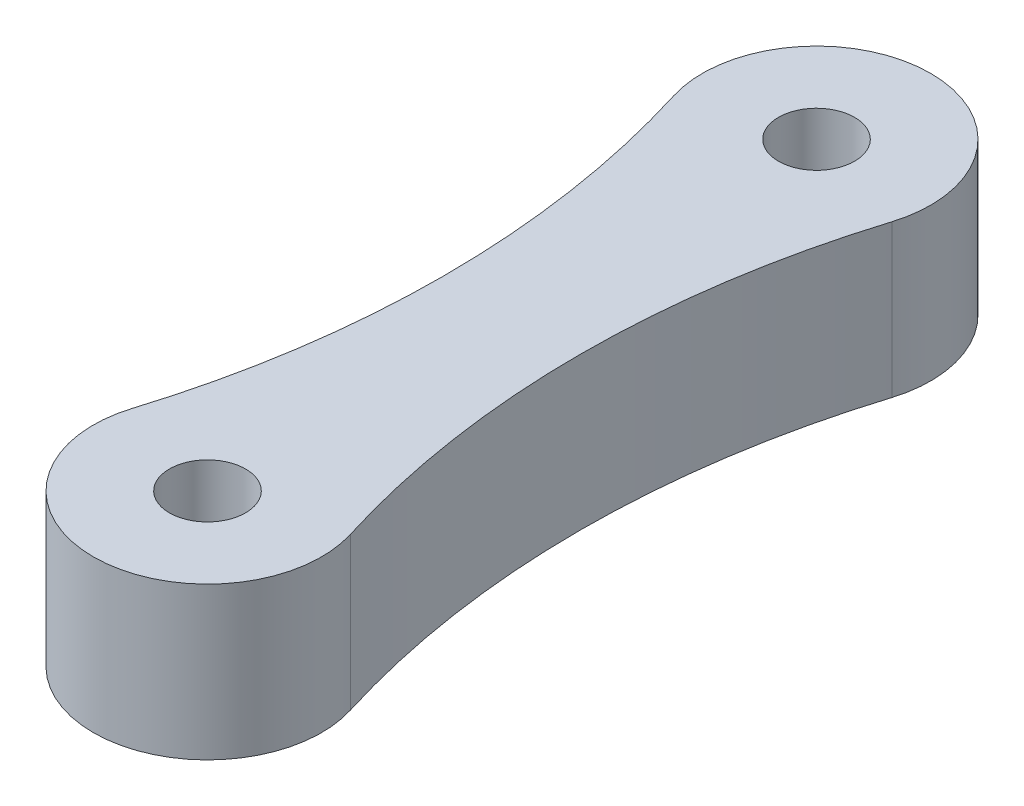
ISO-10303-21;
HEADER;
FILE_DESCRIPTION(('STEP AP214'),'2;1');
FILE_NAME('part.step','',(''),(''),'','','');
FILE_SCHEMA(('AUTOMOTIVE_DESIGN { 1 0 10303 214 1 1 1 1 }'));
ENDSEC;
DATA;
#1=APPLICATION_CONTEXT('core data for automotive mechanical design processes');
#2=APPLICATION_PROTOCOL_DEFINITION('international standard','automotive_design',2000,#1);
#3=PRODUCT_CONTEXT('',#1,'mechanical');
#4=PRODUCT('Part','Part','',(#3));
#5=PRODUCT_RELATED_PRODUCT_CATEGORY('part','',(#4));
#6=PRODUCT_DEFINITION_FORMATION('','',#4);
#7=PRODUCT_DEFINITION_CONTEXT('part definition',#1,'design');
#8=PRODUCT_DEFINITION('design','',#6,#7);
#9=PRODUCT_DEFINITION_SHAPE('','',#8);
#10=(LENGTH_UNIT() NAMED_UNIT(*) SI_UNIT(.MILLI.,.METRE.));
#11=(NAMED_UNIT(*) PLANE_ANGLE_UNIT() SI_UNIT($,.RADIAN.));
#12=(NAMED_UNIT(*) SI_UNIT($,.STERADIAN.) SOLID_ANGLE_UNIT());
#13=UNCERTAINTY_MEASURE_WITH_UNIT(LENGTH_MEASURE(1.E-05),#10,'distance_accuracy_value','');
#14=(GEOMETRIC_REPRESENTATION_CONTEXT(3) GLOBAL_UNCERTAINTY_ASSIGNED_CONTEXT((#13)) GLOBAL_UNIT_ASSIGNED_CONTEXT((#10,
#11,#12)) REPRESENTATION_CONTEXT('',''));
#15=CARTESIAN_POINT('',(0.,0.,0.));
#16=DIRECTION('',(0.,0.,1.));
#17=DIRECTION('',(1.,0.,0.));
#18=AXIS2_PLACEMENT_3D('',#15,#16,#17);
#19=CARTESIAN_POINT('',(-32.2344923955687,5.,-9.99999999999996));
#20=DIRECTION('',(0.,-1.,0.));
#21=DIRECTION('',(0.,0.,-1.));
#22=AXIS2_PLACEMENT_3D('',#19,#20,#21);
#23=PLANE('',#22);
#24=CARTESIAN_POINT('',(6.80011602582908E-13,5.,0.));
#25=DIRECTION('',(0.,1.,0.));
#26=DIRECTION('',(0.,0.,-1.));
#27=AXIS2_PLACEMENT_3D('',#24,#25,#26);
#28=CIRCLE('',#27,7.50000000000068);
#29=CARTESIAN_POINT('',(-7.16322053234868,5.,-2.22222222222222));
#30=VERTEX_POINT('',#29);
#31=CARTESIAN_POINT('',(7.16322053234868,5.,-2.22222222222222));
#32=VERTEX_POINT('',#31);
#33=EDGE_CURVE('E79',#30,#32,#28,.T.);
#34=ORIENTED_EDGE('',*,*,#33,.T.);
#35=CARTESIAN_POINT('',(64.4689847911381,5.,-20.));
#36=DIRECTION('',(0.,-1.,0.));
#37=DIRECTION('',(0.,0.,1.));
#38=AXIS2_PLACEMENT_3D('',#35,#36,#37);
#39=CIRCLE('',#38,60.);
#40=CARTESIAN_POINT('',(7.16322053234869,5.,-37.7777777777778));
#41=VERTEX_POINT('',#40);
#42=EDGE_CURVE('E82',#32,#41,#39,.T.);
#43=ORIENTED_EDGE('',*,*,#42,.T.);
#44=CARTESIAN_POINT('',(-1.27849120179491E-12,5.,-40.0000000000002));
#45=DIRECTION('',(0.,1.,0.));
#46=DIRECTION('',(0.,0.,-1.));
#47=AXIS2_PLACEMENT_3D('',#44,#45,#46);
#48=CIRCLE('',#47,7.50000000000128);
#49=CARTESIAN_POINT('',(-7.16322053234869,5.,-37.7777777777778));
#50=VERTEX_POINT('',#49);
#51=EDGE_CURVE('E86',#41,#50,#48,.T.);
#52=ORIENTED_EDGE('',*,*,#51,.T.);
#53=CARTESIAN_POINT('',(-64.4689847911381,5.,-20.));
#54=DIRECTION('',(0.,-1.,0.));
#55=DIRECTION('',(0.,0.,-1.));
#56=AXIS2_PLACEMENT_3D('',#53,#54,#55);
#57=CIRCLE('',#56,60.);
#58=EDGE_CURVE('E51',#50,#30,#57,.T.);
#59=ORIENTED_EDGE('',*,*,#58,.T.);
#60=EDGE_LOOP('',(#34,#43,#52,#59));
#61=FACE_BOUND('',#60,.T.);
#62=CARTESIAN_POINT('',(0.,5.,-40.));
#63=DIRECTION('',(0.,1.,0.));
#64=DIRECTION('',(0.,0.,1.));
#65=AXIS2_PLACEMENT_3D('',#62,#63,#64);
#66=CIRCLE('',#65,2.5);
#67=CARTESIAN_POINT('',(0.,5.,-37.5));
#68=VERTEX_POINT('',#67);
#69=EDGE_CURVE('E100',#68,#68,#66,.T.);
#70=ORIENTED_EDGE('',*,*,#69,.F.);
#71=EDGE_LOOP('',(#70));
#72=FACE_BOUND('',#71,.T.);
#73=CARTESIAN_POINT('',(0.,5.,0.));
#74=DIRECTION('',(0.,1.,0.));
#75=DIRECTION('',(0.,0.,1.));
#76=AXIS2_PLACEMENT_3D('',#73,#74,#75);
#77=CIRCLE('',#76,2.5);
#78=CARTESIAN_POINT('',(0.,5.,2.5));
#79=VERTEX_POINT('',#78);
#80=EDGE_CURVE('E118',#79,#79,#77,.T.);
#81=ORIENTED_EDGE('',*,*,#80,.F.);
#82=EDGE_LOOP('',(#81));
#83=FACE_BOUND('',#82,.T.);
#84=ADVANCED_FACE('F34',(#61,#72,#83),#23,.F.);
#85=CARTESIAN_POINT('',(-32.2344923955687,-5.,-9.99999999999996));
#86=DIRECTION('',(0.,-1.,0.));
#87=DIRECTION('',(0.,0.,-1.));
#88=AXIS2_PLACEMENT_3D('',#85,#86,#87);
#89=PLANE('',#88);
#90=CARTESIAN_POINT('',(0.,-5.,-40.));
#91=DIRECTION('',(0.,1.,0.));
#92=DIRECTION('',(0.,0.,1.));
#93=AXIS2_PLACEMENT_3D('',#90,#91,#92);
#94=CIRCLE('',#93,2.5);
#95=CARTESIAN_POINT('',(0.,-5.,-37.5));
#96=VERTEX_POINT('',#95);
#97=EDGE_CURVE('E121',#96,#96,#94,.T.);
#98=ORIENTED_EDGE('',*,*,#97,.T.);
#99=EDGE_LOOP('',(#98));
#100=FACE_BOUND('',#99,.T.);
#101=CARTESIAN_POINT('',(-4.46691295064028E-13,-5.,0.));
#102=DIRECTION('',(0.,1.,0.));
#103=DIRECTION('',(0.,0.,1.));
#104=AXIS2_PLACEMENT_3D('',#101,#102,#103);
#105=CIRCLE('',#104,7.50000000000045);
#106=CARTESIAN_POINT('',(-7.16322053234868,-5.,-2.22222222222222));
#107=VERTEX_POINT('',#106);
#108=CARTESIAN_POINT('',(7.16322053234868,-5.,-2.22222222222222));
#109=VERTEX_POINT('',#108);
#110=EDGE_CURVE('E74',#107,#109,#105,.T.);
#111=ORIENTED_EDGE('',*,*,#110,.F.);
#112=CARTESIAN_POINT('',(-64.4689847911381,-5.,-20.));
#113=DIRECTION('',(0.,-1.,0.));
#114=DIRECTION('',(0.,0.,-1.));
#115=AXIS2_PLACEMENT_3D('',#112,#113,#114);
#116=CIRCLE('',#115,60.);
#117=CARTESIAN_POINT('',(-7.16322053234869,-5.,-37.7777777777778));
#118=VERTEX_POINT('',#117);
#119=EDGE_CURVE('E103',#118,#107,#116,.T.);
#120=ORIENTED_EDGE('',*,*,#119,.F.);
#121=CARTESIAN_POINT('',(4.51895465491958E-13,-5.,-40.0000000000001));
#122=DIRECTION('',(0.,1.,0.));
#123=DIRECTION('',(0.,0.,-1.));
#124=AXIS2_PLACEMENT_3D('',#121,#122,#123);
#125=CIRCLE('',#124,7.50000000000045);
#126=CARTESIAN_POINT('',(7.16322053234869,-5.,-37.7777777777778));
#127=VERTEX_POINT('',#126);
#128=EDGE_CURVE('E67',#127,#118,#125,.T.);
#129=ORIENTED_EDGE('',*,*,#128,.F.);
#130=CARTESIAN_POINT('',(64.4689847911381,-5.,-20.));
#131=DIRECTION('',(0.,-1.,0.));
#132=DIRECTION('',(0.,0.,1.));
#133=AXIS2_PLACEMENT_3D('',#130,#131,#132);
#134=CIRCLE('',#133,60.);
#135=EDGE_CURVE('E91',#109,#127,#134,.T.);
#136=ORIENTED_EDGE('',*,*,#135,.F.);
#137=EDGE_LOOP('',(#111,#120,#129,#136));
#138=FACE_BOUND('',#137,.T.);
#139=CARTESIAN_POINT('',(0.,-5.,0.));
#140=DIRECTION('',(0.,1.,0.));
#141=DIRECTION('',(0.,0.,1.));
#142=AXIS2_PLACEMENT_3D('',#139,#140,#141);
#143=CIRCLE('',#142,2.5);
#144=CARTESIAN_POINT('',(0.,-5.,2.5));
#145=VERTEX_POINT('',#144);
#146=EDGE_CURVE('E116',#145,#145,#143,.T.);
#147=ORIENTED_EDGE('',*,*,#146,.T.);
#148=EDGE_LOOP('',(#147));
#149=FACE_BOUND('',#148,.T.);
#150=ADVANCED_FACE('F109',(#100,#138,#149),#89,.T.);
#151=CARTESIAN_POINT('',(-4.46691295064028E-13,5.,0.));
#152=DIRECTION('',(0.,-1.,0.));
#153=DIRECTION('',(0.,0.,-1.));
#154=AXIS2_PLACEMENT_3D('',#151,#152,#153);
#155=CYLINDRICAL_SURFACE('',#154,7.50000000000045);
#156=ORIENTED_EDGE('',*,*,#110,.T.);
#157=DIRECTION('',(0.,-1.,0.));
#158=VECTOR('',#157,1.);
#159=CARTESIAN_POINT('',(7.16322053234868,5.,-2.22222222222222));
#160=LINE('',#159,#158);
#161=EDGE_CURVE('E11',#32,#109,#160,.T.);
#162=ORIENTED_EDGE('',*,*,#161,.F.);
#163=ORIENTED_EDGE('',*,*,#33,.F.);
#164=DIRECTION('',(0.,-1.,0.));
#165=VECTOR('',#164,1.);
#166=CARTESIAN_POINT('',(-7.16322053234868,5.,-2.22222222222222));
#167=LINE('',#166,#165);
#168=EDGE_CURVE('E95',#30,#107,#167,.T.);
#169=ORIENTED_EDGE('',*,*,#168,.T.);
#170=EDGE_LOOP('',(#156,#162,#163,#169));
#171=FACE_BOUND('',#170,.T.);
#172=ADVANCED_FACE('F36',(#171),#155,.T.);
#173=CARTESIAN_POINT('',(64.4689847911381,5.,-20.));
#174=DIRECTION('',(0.,-1.,0.));
#175=DIRECTION('',(0.,0.,-1.));
#176=AXIS2_PLACEMENT_3D('',#173,#174,#175);
#177=CYLINDRICAL_SURFACE('',#176,60.);
#178=ORIENTED_EDGE('',*,*,#135,.T.);
#179=DIRECTION('',(0.,-1.,0.));
#180=VECTOR('',#179,1.);
#181=CARTESIAN_POINT('',(7.16322053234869,5.,-37.7777777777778));
#182=LINE('',#181,#180);
#183=EDGE_CURVE('E43',#41,#127,#182,.T.);
#184=ORIENTED_EDGE('',*,*,#183,.F.);
#185=ORIENTED_EDGE('',*,*,#42,.F.);
#186=ORIENTED_EDGE('',*,*,#161,.T.);
#187=EDGE_LOOP('',(#178,#184,#185,#186));
#188=FACE_BOUND('',#187,.T.);
#189=ADVANCED_FACE('F90',(#188),#177,.F.);
#190=CARTESIAN_POINT('',(4.51895465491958E-13,5.,-40.0000000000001));
#191=DIRECTION('',(0.,-1.,0.));
#192=DIRECTION('',(0.,0.,-1.));
#193=AXIS2_PLACEMENT_3D('',#190,#191,#192);
#194=CYLINDRICAL_SURFACE('',#193,7.50000000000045);
#195=ORIENTED_EDGE('',*,*,#128,.T.);
#196=DIRECTION('',(0.,-1.,0.));
#197=VECTOR('',#196,1.);
#198=CARTESIAN_POINT('',(-7.16322053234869,5.,-37.7777777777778));
#199=LINE('',#198,#197);
#200=EDGE_CURVE('E92',#50,#118,#199,.T.);
#201=ORIENTED_EDGE('',*,*,#200,.F.);
#202=ORIENTED_EDGE('',*,*,#51,.F.);
#203=ORIENTED_EDGE('',*,*,#183,.T.);
#204=EDGE_LOOP('',(#195,#201,#202,#203));
#205=FACE_BOUND('',#204,.T.);
#206=ADVANCED_FACE('F93',(#205),#194,.T.);
#207=CARTESIAN_POINT('',(-64.4689847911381,5.,-20.));
#208=DIRECTION('',(0.,-1.,0.));
#209=DIRECTION('',(0.,0.,-1.));
#210=AXIS2_PLACEMENT_3D('',#207,#208,#209);
#211=CYLINDRICAL_SURFACE('',#210,60.);
#212=ORIENTED_EDGE('',*,*,#119,.T.);
#213=ORIENTED_EDGE('',*,*,#168,.F.);
#214=ORIENTED_EDGE('',*,*,#58,.F.);
#215=ORIENTED_EDGE('',*,*,#200,.T.);
#216=EDGE_LOOP('',(#212,#213,#214,#215));
#217=FACE_BOUND('',#216,.T.);
#218=ADVANCED_FACE('F108',(#217),#211,.F.);
#219=CARTESIAN_POINT('',(0.,5.,-40.));
#220=DIRECTION('',(0.,-1.,0.));
#221=DIRECTION('',(0.,0.,-1.));
#222=AXIS2_PLACEMENT_3D('',#219,#220,#221);
#223=CYLINDRICAL_SURFACE('',#222,2.5);
#224=ORIENTED_EDGE('',*,*,#69,.T.);
#225=EDGE_LOOP('',(#224));
#226=FACE_BOUND('',#225,.T.);
#227=ORIENTED_EDGE('',*,*,#97,.F.);
#228=EDGE_LOOP('',(#227));
#229=FACE_BOUND('',#228,.T.);
#230=ADVANCED_FACE('F129',(#226,#229),#223,.F.);
#231=CARTESIAN_POINT('',(0.,5.,0.));
#232=DIRECTION('',(0.,-1.,0.));
#233=DIRECTION('',(0.,0.,-1.));
#234=AXIS2_PLACEMENT_3D('',#231,#232,#233);
#235=CYLINDRICAL_SURFACE('',#234,2.5);
#236=ORIENTED_EDGE('',*,*,#80,.T.);
#237=EDGE_LOOP('',(#236));
#238=FACE_BOUND('',#237,.T.);
#239=ORIENTED_EDGE('',*,*,#146,.F.);
#240=EDGE_LOOP('',(#239));
#241=FACE_BOUND('',#240,.T.);
#242=ADVANCED_FACE('F131',(#238,#241),#235,.F.);
#243=CLOSED_SHELL('',(#84,#150,#172,#189,#206,#218,#230,#242));
#244=MANIFOLD_SOLID_BREP('B2',#243);
#245=ADVANCED_BREP_SHAPE_REPRESENTATION('',(#18,#244),#14);
#246=SHAPE_DEFINITION_REPRESENTATION(#9,#245);
ENDSEC;
END-ISO-10303-21;
